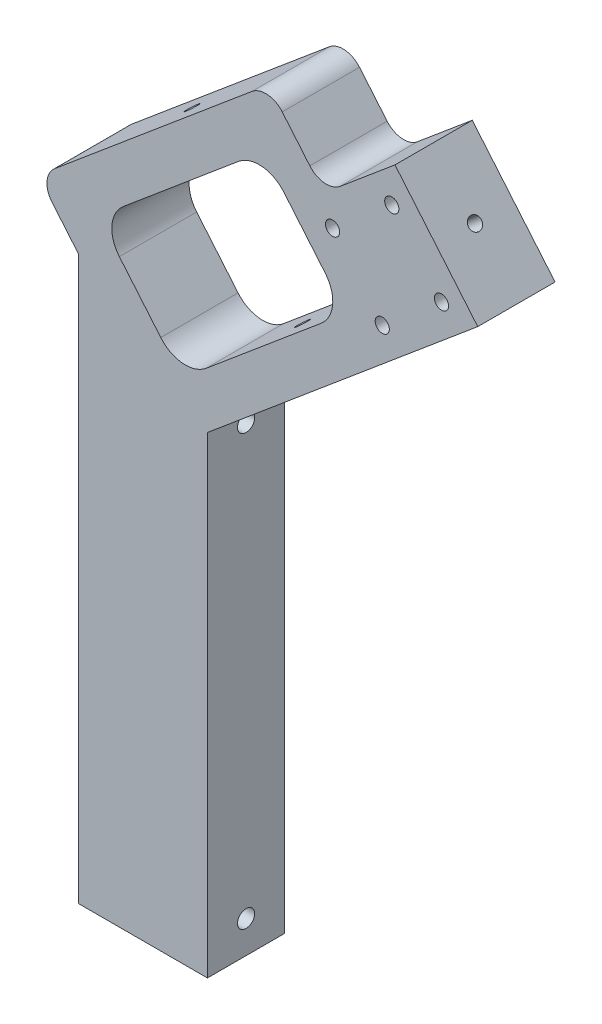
ISO-10303-21;
HEADER;
FILE_DESCRIPTION(('STEP AP214'),'2;1');
FILE_NAME('part.step','',(''),(''),'','','');
FILE_SCHEMA(('AUTOMOTIVE_DESIGN { 1 0 10303 214 1 1 1 1 }'));
ENDSEC;
DATA;
#1=APPLICATION_CONTEXT('core data for automotive mechanical design processes');
#2=APPLICATION_PROTOCOL_DEFINITION('international standard','automotive_design',2000,#1);
#3=PRODUCT_CONTEXT('',#1,'mechanical');
#4=PRODUCT('Part','Part','',(#3));
#5=PRODUCT_RELATED_PRODUCT_CATEGORY('part','',(#4));
#6=PRODUCT_DEFINITION_FORMATION('','',#4);
#7=PRODUCT_DEFINITION_CONTEXT('part definition',#1,'design');
#8=PRODUCT_DEFINITION('design','',#6,#7);
#9=PRODUCT_DEFINITION_SHAPE('','',#8);
#10=(LENGTH_UNIT() NAMED_UNIT(*) SI_UNIT(.MILLI.,.METRE.));
#11=(NAMED_UNIT(*) PLANE_ANGLE_UNIT() SI_UNIT($,.RADIAN.));
#12=(NAMED_UNIT(*) SI_UNIT($,.STERADIAN.) SOLID_ANGLE_UNIT());
#13=UNCERTAINTY_MEASURE_WITH_UNIT(LENGTH_MEASURE(1.E-05),#10,'distance_accuracy_value','');
#14=(GEOMETRIC_REPRESENTATION_CONTEXT(3) GLOBAL_UNCERTAINTY_ASSIGNED_CONTEXT((#13)) GLOBAL_UNIT_ASSIGNED_CONTEXT((#10,
#11,#12)) REPRESENTATION_CONTEXT('',''));
#15=CARTESIAN_POINT('',(0.,0.,0.));
#16=DIRECTION('',(0.,0.,1.));
#17=DIRECTION('',(1.,0.,0.));
#18=AXIS2_PLACEMENT_3D('',#15,#16,#17);
#19=CARTESIAN_POINT('',(-79.7051461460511,143.222848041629,18.));
#20=DIRECTION('',(0.,0.,1.));
#21=DIRECTION('',(1.,0.,0.));
#22=AXIS2_PLACEMENT_3D('',#19,#20,#21);
#23=PLANE('',#22);
#24=CARTESIAN_POINT('',(94.0370996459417,187.188133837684,18.));
#25=DIRECTION('',(0.,0.,1.));
#26=DIRECTION('',(1.,0.,0.));
#27=AXIS2_PLACEMENT_3D('',#24,#25,#26);
#28=CIRCLE('',#27,3.3);
#29=CARTESIAN_POINT('',(97.3370996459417,187.188133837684,18.));
#30=VERTEX_POINT('',#29);
#31=EDGE_CURVE('E365',#30,#30,#28,.T.);
#32=ORIENTED_EDGE('',*,*,#31,.F.);
#33=EDGE_LOOP('',(#32));
#34=FACE_BOUND('',#33,.T.);
#35=CARTESIAN_POINT('',(43.3191457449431,191.625379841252,18.));
#36=DIRECTION('',(0.,0.,1.));
#37=DIRECTION('',(1.,0.,0.));
#38=AXIS2_PLACEMENT_3D('',#35,#36,#37);
#39=CIRCLE('',#38,3.3);
#40=CARTESIAN_POINT('',(46.6191457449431,191.625379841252,18.));
#41=VERTEX_POINT('',#40);
#42=EDGE_CURVE('E214',#41,#41,#39,.T.);
#43=ORIENTED_EDGE('',*,*,#42,.F.);
#44=EDGE_LOOP('',(#43));
#45=FACE_BOUND('',#44,.T.);
#46=DIRECTION('',(1.,0.,0.));
#47=VECTOR('',#46,1.);
#48=CARTESIAN_POINT('',(-14.9598612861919,-139.936063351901,18.));
#49=LINE('',#48,#47);
#50=CARTESIAN_POINT('',(-74.9598612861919,-139.936063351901,18.));
#51=VERTEX_POINT('',#50);
#52=CARTESIAN_POINT('',(-14.9598612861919,-139.936063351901,18.));
#53=VERTEX_POINT('',#52);
#54=EDGE_CURVE('E244',#51,#53,#49,.T.);
#55=ORIENTED_EDGE('',*,*,#54,.T.);
#56=DIRECTION('',(0.,1.,0.));
#57=VECTOR('',#56,1.);
#58=CARTESIAN_POINT('',(-14.9598612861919,80.0639366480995,18.));
#59=LINE('',#58,#57);
#60=CARTESIAN_POINT('',(-14.9598612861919,80.0639366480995,18.));
#61=VERTEX_POINT('',#60);
#62=EDGE_CURVE('E247',#53,#61,#59,.T.);
#63=ORIENTED_EDGE('',*,*,#62,.T.);
#64=DIRECTION('',(0.766044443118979,0.642787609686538,0.));
#65=VECTOR('',#64,1.);
#66=CARTESIAN_POINT('',(110.943084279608,185.709051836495,18.));
#67=LINE('',#66,#65);
#68=CARTESIAN_POINT('',(110.943084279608,185.709051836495,18.));
#69=VERTEX_POINT('',#68);
#70=EDGE_CURVE('E250',#61,#69,#67,.T.);
#71=ORIENTED_EDGE('',*,*,#70,.T.);
#72=DIRECTION('',(-0.642787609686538,0.766044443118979,0.));
#73=VECTOR('',#72,1.);
#74=CARTESIAN_POINT('',(72.3758276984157,231.671718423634,18.));
#75=LINE('',#74,#73);
#76=CARTESIAN_POINT('',(72.3758276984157,231.671718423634,18.));
#77=VERTEX_POINT('',#76);
#78=EDGE_CURVE('E252',#69,#77,#75,.T.);
#79=ORIENTED_EDGE('',*,*,#78,.T.);
#80=DIRECTION('',(-0.766044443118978,-0.642787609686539,0.));
#81=VECTOR('',#80,1.);
#82=CARTESIAN_POINT('',(46.8247041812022,210.231780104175,18.));
#83=LINE('',#82,#81);
#84=CARTESIAN_POINT('',(46.8247041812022,210.231780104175,18.));
#85=VERTEX_POINT('',#84);
#86=EDGE_CURVE('E254',#77,#85,#83,.T.);
#87=ORIENTED_EDGE('',*,*,#86,.T.);
#88=CARTESIAN_POINT('',(40.3968280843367,217.892224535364,18.));
#89=DIRECTION('',(0.,0.,-1.));
#90=DIRECTION('',(-1.,0.,0.));
#91=AXIS2_PLACEMENT_3D('',#88,#89,#90);
#92=CIRCLE('',#91,9.99999999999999);
#93=CARTESIAN_POINT('',(32.7363836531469,211.464348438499,18.));
#94=VERTEX_POINT('',#93);
#95=EDGE_CURVE('E256',#85,#94,#92,.T.);
#96=ORIENTED_EDGE('',*,*,#95,.T.);
#97=DIRECTION('',(-0.642787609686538,0.766044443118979,0.));
#98=VECTOR('',#97,1.);
#99=CARTESIAN_POINT('',(32.7363836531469,211.464348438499,18.));
#100=LINE('',#99,#98);
#101=CARTESIAN_POINT('',(19.8806314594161,226.785237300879,18.));
#102=VERTEX_POINT('',#101);
#103=EDGE_CURVE('E258',#94,#102,#100,.T.);
#104=ORIENTED_EDGE('',*,*,#103,.T.);
#105=CARTESIAN_POINT('',(12.2201870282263,220.357361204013,18.));
#106=DIRECTION('',(0.,0.,1.));
#107=DIRECTION('',(1.,0.,0.));
#108=AXIS2_PLACEMENT_3D('',#105,#106,#107);
#109=CIRCLE('',#108,9.99999999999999);
#110=CARTESIAN_POINT('',(5.79231093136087,228.017805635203,18.));
#111=VERTEX_POINT('',#110);
#112=EDGE_CURVE('E260',#102,#111,#109,.T.);
#113=ORIENTED_EDGE('',*,*,#112,.T.);
#114=DIRECTION('',(-0.766044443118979,-0.642787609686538,0.));
#115=VECTOR('',#114,1.);
#116=CARTESIAN_POINT('',(-86.1330222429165,150.883292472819,18.));
#117=LINE('',#116,#115);
#118=CARTESIAN_POINT('',(-86.1330222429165,150.883292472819,18.));
#119=VERTEX_POINT('',#118);
#120=EDGE_CURVE('E262',#111,#119,#117,.T.);
#121=ORIENTED_EDGE('',*,*,#120,.T.);
#122=CARTESIAN_POINT('',(-79.7051461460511,143.222848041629,18.));
#123=DIRECTION('',(0.,0.,1.));
#124=DIRECTION('',(1.,0.,0.));
#125=AXIS2_PLACEMENT_3D('',#122,#123,#124);
#126=CIRCLE('',#125,10.);
#127=CARTESIAN_POINT('',(-87.3655905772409,136.794971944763,18.));
#128=VERTEX_POINT('',#127);
#129=EDGE_CURVE('E264',#119,#128,#126,.T.);
#130=ORIENTED_EDGE('',*,*,#129,.T.);
#131=DIRECTION('',(0.642787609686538,-0.766044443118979,0.));
#132=VECTOR('',#131,1.);
#133=CARTESIAN_POINT('',(-74.9598612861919,122.010399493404,18.));
#134=LINE('',#133,#132);
#135=CARTESIAN_POINT('',(-74.9598612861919,122.010399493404,18.));
#136=VERTEX_POINT('',#135);
#137=EDGE_CURVE('E266',#128,#136,#134,.T.);
#138=ORIENTED_EDGE('',*,*,#137,.T.);
#139=DIRECTION('',(0.,-1.,0.));
#140=VECTOR('',#139,1.);
#141=CARTESIAN_POINT('',(-74.9598612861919,-139.936063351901,18.));
#142=LINE('',#141,#140);
#143=EDGE_CURVE('E268',#136,#51,#142,.T.);
#144=ORIENTED_EDGE('',*,*,#143,.T.);
#145=EDGE_LOOP('',(#55,#63,#71,#79,#87,#96,#104,#113,#121,#130,#138,#144));
#146=FACE_BOUND('',#145,.T.);
#147=DIRECTION('',(0.642787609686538,-0.766044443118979,0.));
#148=VECTOR('',#147,1.);
#149=CARTESIAN_POINT('',(-36.6913831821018,107.51827976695,18.));
#150=LINE('',#149,#148);
#151=CARTESIAN_POINT('',(-55.9750114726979,130.49961306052,18.));
#152=VERTEX_POINT('',#151);
#153=CARTESIAN_POINT('',(-36.6913831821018,107.51827976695,18.));
#154=VERTEX_POINT('',#153);
#155=EDGE_CURVE('E184',#152,#154,#150,.T.);
#156=ORIENTED_EDGE('',*,*,#155,.F.);
#157=CARTESIAN_POINT('',(-44.4843448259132,140.141427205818,18.));
#158=DIRECTION('',(0.,0.,1.));
#159=DIRECTION('',(1.,0.,0.));
#160=AXIS2_PLACEMENT_3D('',#157,#158,#159);
#161=CIRCLE('',#160,15.);
#162=CARTESIAN_POINT('',(-54.1261589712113,151.632093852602,18.));
#163=VERTEX_POINT('',#162);
#164=EDGE_CURVE('E176',#163,#152,#161,.T.);
#165=ORIENTED_EDGE('',*,*,#164,.F.);
#166=DIRECTION('',(-0.766044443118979,-0.642787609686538,0.));
#167=VECTOR('',#166,1.);
#168=CARTESIAN_POINT('',(-54.1261589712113,151.632093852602,18.));
#169=LINE('',#168,#167);
#170=CARTESIAN_POINT('',(-0.503047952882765,196.62722653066,18.));
#171=VERTEX_POINT('',#170);
#172=EDGE_CURVE('E211',#171,#163,#169,.T.);
#173=ORIENTED_EDGE('',*,*,#172,.F.);
#174=CARTESIAN_POINT('',(9.1387661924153,185.136559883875,18.));
#175=DIRECTION('',(0.,0.,1.));
#176=DIRECTION('',(1.,0.,0.));
#177=AXIS2_PLACEMENT_3D('',#174,#175,#176);
#178=CIRCLE('',#177,15.);
#179=CARTESIAN_POINT('',(20.6294328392,194.778374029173,18.));
#180=VERTEX_POINT('',#179);
#181=EDGE_CURVE('E209',#180,#171,#178,.T.);
#182=ORIENTED_EDGE('',*,*,#181,.F.);
#183=DIRECTION('',(-0.642787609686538,0.766044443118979,0.));
#184=VECTOR('',#183,1.);
#185=CARTESIAN_POINT('',(39.9130611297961,171.797040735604,18.));
#186=LINE('',#185,#184);
#187=CARTESIAN_POINT('',(39.9130611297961,171.797040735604,18.));
#188=VERTEX_POINT('',#187);
#189=EDGE_CURVE('E207',#188,#180,#186,.T.);
#190=ORIENTED_EDGE('',*,*,#189,.F.);
#191=CARTESIAN_POINT('',(28.4223944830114,162.155226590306,18.));
#192=DIRECTION('',(0.,0.,1.));
#193=DIRECTION('',(1.,0.,0.));
#194=AXIS2_PLACEMENT_3D('',#191,#192,#193);
#195=CIRCLE('',#194,15.);
#196=CARTESIAN_POINT('',(38.0642086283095,150.664559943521,18.));
#197=VERTEX_POINT('',#196);
#198=EDGE_CURVE('E205',#197,#188,#195,.T.);
#199=ORIENTED_EDGE('',*,*,#198,.F.);
#200=DIRECTION('',(0.766044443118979,0.642787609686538,0.));
#201=VECTOR('',#200,1.);
#202=CARTESIAN_POINT('',(-15.558902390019,105.669427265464,18.));
#203=LINE('',#202,#201);
#204=CARTESIAN_POINT('',(-15.558902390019,105.669427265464,18.));
#205=VERTEX_POINT('',#204);
#206=EDGE_CURVE('E200',#205,#197,#203,.T.);
#207=ORIENTED_EDGE('',*,*,#206,.F.);
#208=CARTESIAN_POINT('',(-25.2007165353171,117.160093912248,18.));
#209=DIRECTION('',(0.,0.,1.));
#210=DIRECTION('',(1.,0.,0.));
#211=AXIS2_PLACEMENT_3D('',#208,#209,#210);
#212=CIRCLE('',#211,15.);
#213=EDGE_CURVE('E198',#154,#205,#212,.T.);
#214=ORIENTED_EDGE('',*,*,#213,.F.);
#215=EDGE_LOOP('',(#156,#165,#173,#182,#190,#199,#207,#214));
#216=FACE_BOUND('',#215,.T.);
#217=CARTESIAN_POINT('',(70.8967456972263,214.765733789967,18.));
#218=DIRECTION('',(0.,0.,1.));
#219=DIRECTION('',(1.,0.,0.));
#220=AXIS2_PLACEMENT_3D('',#217,#218,#219);
#221=CIRCLE('',#220,3.3);
#222=CARTESIAN_POINT('',(74.1967456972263,214.765733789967,18.));
#223=VERTEX_POINT('',#222);
#224=EDGE_CURVE('E371',#223,#223,#221,.T.);
#225=ORIENTED_EDGE('',*,*,#224,.F.);
#226=EDGE_LOOP('',(#225));
#227=FACE_BOUND('',#226,.T.);
#228=CARTESIAN_POINT('',(66.4594996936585,164.047779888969,18.));
#229=DIRECTION('',(0.,0.,1.));
#230=DIRECTION('',(1.,0.,0.));
#231=AXIS2_PLACEMENT_3D('',#228,#229,#230);
#232=CIRCLE('',#231,3.3);
#233=CARTESIAN_POINT('',(69.7594996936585,164.047779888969,18.));
#234=VERTEX_POINT('',#233);
#235=EDGE_CURVE('E359',#234,#234,#232,.T.);
#236=ORIENTED_EDGE('',*,*,#235,.F.);
#237=EDGE_LOOP('',(#236));
#238=FACE_BOUND('',#237,.T.);
#239=ADVANCED_FACE('F33',(#34,#45,#146,#216,#227,#238),#23,.T.);
#240=CARTESIAN_POINT('',(-79.7051461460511,143.222848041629,-18.));
#241=DIRECTION('',(0.,0.,1.));
#242=DIRECTION('',(1.,0.,0.));
#243=AXIS2_PLACEMENT_3D('',#240,#241,#242);
#244=PLANE('',#243);
#245=DIRECTION('',(1.,0.,0.));
#246=VECTOR('',#245,1.);
#247=CARTESIAN_POINT('',(-14.9598612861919,-139.936063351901,-18.));
#248=LINE('',#247,#246);
#249=CARTESIAN_POINT('',(-74.9598612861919,-139.936063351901,-18.));
#250=VERTEX_POINT('',#249);
#251=CARTESIAN_POINT('',(-14.9598612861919,-139.936063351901,-18.));
#252=VERTEX_POINT('',#251);
#253=EDGE_CURVE('E192',#250,#252,#248,.T.);
#254=ORIENTED_EDGE('',*,*,#253,.F.);
#255=DIRECTION('',(0.,-1.,0.));
#256=VECTOR('',#255,1.);
#257=CARTESIAN_POINT('',(-74.9598612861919,-139.936063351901,-18.));
#258=LINE('',#257,#256);
#259=CARTESIAN_POINT('',(-74.9598612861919,122.010399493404,-18.));
#260=VERTEX_POINT('',#259);
#261=EDGE_CURVE('E248',#260,#250,#258,.T.);
#262=ORIENTED_EDGE('',*,*,#261,.F.);
#263=DIRECTION('',(0.642787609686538,-0.766044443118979,0.));
#264=VECTOR('',#263,1.);
#265=CARTESIAN_POINT('',(-74.9598612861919,122.010399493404,-18.));
#266=LINE('',#265,#264);
#267=CARTESIAN_POINT('',(-87.3655905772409,136.794971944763,-18.));
#268=VERTEX_POINT('',#267);
#269=EDGE_CURVE('E291',#268,#260,#266,.T.);
#270=ORIENTED_EDGE('',*,*,#269,.F.);
#271=CARTESIAN_POINT('',(-79.7051461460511,143.222848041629,-18.));
#272=DIRECTION('',(0.,0.,1.));
#273=DIRECTION('',(1.,0.,0.));
#274=AXIS2_PLACEMENT_3D('',#271,#272,#273);
#275=CIRCLE('',#274,10.);
#276=CARTESIAN_POINT('',(-86.1330222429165,150.883292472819,-18.));
#277=VERTEX_POINT('',#276);
#278=EDGE_CURVE('E289',#277,#268,#275,.T.);
#279=ORIENTED_EDGE('',*,*,#278,.F.);
#280=DIRECTION('',(-0.766044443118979,-0.642787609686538,0.));
#281=VECTOR('',#280,1.);
#282=CARTESIAN_POINT('',(-86.1330222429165,150.883292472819,-18.));
#283=LINE('',#282,#281);
#284=CARTESIAN_POINT('',(5.79231093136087,228.017805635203,-18.));
#285=VERTEX_POINT('',#284);
#286=EDGE_CURVE('E287',#285,#277,#283,.T.);
#287=ORIENTED_EDGE('',*,*,#286,.F.);
#288=CARTESIAN_POINT('',(12.2201870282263,220.357361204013,-18.));
#289=DIRECTION('',(0.,0.,1.));
#290=DIRECTION('',(1.,0.,0.));
#291=AXIS2_PLACEMENT_3D('',#288,#289,#290);
#292=CIRCLE('',#291,9.99999999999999);
#293=CARTESIAN_POINT('',(19.8806314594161,226.785237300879,-18.));
#294=VERTEX_POINT('',#293);
#295=EDGE_CURVE('E285',#294,#285,#292,.T.);
#296=ORIENTED_EDGE('',*,*,#295,.F.);
#297=DIRECTION('',(-0.642787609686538,0.766044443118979,0.));
#298=VECTOR('',#297,1.);
#299=CARTESIAN_POINT('',(32.7363836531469,211.464348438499,-18.));
#300=LINE('',#299,#298);
#301=CARTESIAN_POINT('',(32.7363836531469,211.464348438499,-18.));
#302=VERTEX_POINT('',#301);
#303=EDGE_CURVE('E283',#302,#294,#300,.T.);
#304=ORIENTED_EDGE('',*,*,#303,.F.);
#305=CARTESIAN_POINT('',(40.3968280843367,217.892224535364,-18.));
#306=DIRECTION('',(0.,0.,-1.));
#307=DIRECTION('',(-1.,0.,0.));
#308=AXIS2_PLACEMENT_3D('',#305,#306,#307);
#309=CIRCLE('',#308,9.99999999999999);
#310=CARTESIAN_POINT('',(46.8247041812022,210.231780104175,-18.));
#311=VERTEX_POINT('',#310);
#312=EDGE_CURVE('E281',#311,#302,#309,.T.);
#313=ORIENTED_EDGE('',*,*,#312,.F.);
#314=DIRECTION('',(-0.766044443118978,-0.642787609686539,0.));
#315=VECTOR('',#314,1.);
#316=CARTESIAN_POINT('',(46.8247041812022,210.231780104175,-18.));
#317=LINE('',#316,#315);
#318=CARTESIAN_POINT('',(72.3758276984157,231.671718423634,-18.));
#319=VERTEX_POINT('',#318);
#320=EDGE_CURVE('E279',#319,#311,#317,.T.);
#321=ORIENTED_EDGE('',*,*,#320,.F.);
#322=DIRECTION('',(-0.642787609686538,0.766044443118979,0.));
#323=VECTOR('',#322,1.);
#324=CARTESIAN_POINT('',(72.3758276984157,231.671718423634,-18.));
#325=LINE('',#324,#323);
#326=CARTESIAN_POINT('',(110.943084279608,185.709051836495,-18.));
#327=VERTEX_POINT('',#326);
#328=EDGE_CURVE('E277',#327,#319,#325,.T.);
#329=ORIENTED_EDGE('',*,*,#328,.F.);
#330=DIRECTION('',(0.766044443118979,0.642787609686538,0.));
#331=VECTOR('',#330,1.);
#332=CARTESIAN_POINT('',(110.943084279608,185.709051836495,-18.));
#333=LINE('',#332,#331);
#334=CARTESIAN_POINT('',(-14.9598612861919,80.0639366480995,-18.));
#335=VERTEX_POINT('',#334);
#336=EDGE_CURVE('E275',#335,#327,#333,.T.);
#337=ORIENTED_EDGE('',*,*,#336,.F.);
#338=DIRECTION('',(0.,1.,0.));
#339=VECTOR('',#338,1.);
#340=CARTESIAN_POINT('',(-14.9598612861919,80.0639366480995,-18.));
#341=LINE('',#340,#339);
#342=EDGE_CURVE('E273',#252,#335,#341,.T.);
#343=ORIENTED_EDGE('',*,*,#342,.F.);
#344=EDGE_LOOP('',(#254,#262,#270,#279,#287,#296,#304,#313,#321,#329,#337,#343));
#345=FACE_BOUND('',#344,.T.);
#346=CARTESIAN_POINT('',(-44.4843448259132,140.141427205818,-18.));
#347=DIRECTION('',(0.,0.,1.));
#348=DIRECTION('',(1.,0.,0.));
#349=AXIS2_PLACEMENT_3D('',#346,#347,#348);
#350=CIRCLE('',#349,15.);
#351=CARTESIAN_POINT('',(-54.1261589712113,151.632093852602,-18.));
#352=VERTEX_POINT('',#351);
#353=CARTESIAN_POINT('',(-55.9750114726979,130.49961306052,-18.));
#354=VERTEX_POINT('',#353);
#355=EDGE_CURVE('E62',#352,#354,#350,.T.);
#356=ORIENTED_EDGE('',*,*,#355,.T.);
#357=DIRECTION('',(0.642787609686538,-0.766044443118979,0.));
#358=VECTOR('',#357,1.);
#359=CARTESIAN_POINT('',(-36.6913831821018,107.51827976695,-18.));
#360=LINE('',#359,#358);
#361=CARTESIAN_POINT('',(-36.6913831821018,107.51827976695,-18.));
#362=VERTEX_POINT('',#361);
#363=EDGE_CURVE('E191',#354,#362,#360,.T.);
#364=ORIENTED_EDGE('',*,*,#363,.T.);
#365=CARTESIAN_POINT('',(-25.2007165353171,117.160093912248,-18.));
#366=DIRECTION('',(0.,0.,1.));
#367=DIRECTION('',(1.,0.,0.));
#368=AXIS2_PLACEMENT_3D('',#365,#366,#367);
#369=CIRCLE('',#368,15.);
#370=CARTESIAN_POINT('',(-15.558902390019,105.669427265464,-18.));
#371=VERTEX_POINT('',#370);
#372=EDGE_CURVE('E216',#362,#371,#369,.T.);
#373=ORIENTED_EDGE('',*,*,#372,.T.);
#374=DIRECTION('',(0.766044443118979,0.642787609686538,0.));
#375=VECTOR('',#374,1.);
#376=CARTESIAN_POINT('',(-15.558902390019,105.669427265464,-18.));
#377=LINE('',#376,#375);
#378=CARTESIAN_POINT('',(38.0642086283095,150.664559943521,-18.));
#379=VERTEX_POINT('',#378);
#380=EDGE_CURVE('E219',#371,#379,#377,.T.);
#381=ORIENTED_EDGE('',*,*,#380,.T.);
#382=CARTESIAN_POINT('',(28.4223944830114,162.155226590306,-18.));
#383=DIRECTION('',(0.,0.,1.));
#384=DIRECTION('',(1.,0.,0.));
#385=AXIS2_PLACEMENT_3D('',#382,#383,#384);
#386=CIRCLE('',#385,15.);
#387=CARTESIAN_POINT('',(39.9130611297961,171.797040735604,-18.));
#388=VERTEX_POINT('',#387);
#389=EDGE_CURVE('E222',#379,#388,#386,.T.);
#390=ORIENTED_EDGE('',*,*,#389,.T.);
#391=DIRECTION('',(-0.642787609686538,0.766044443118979,0.));
#392=VECTOR('',#391,1.);
#393=CARTESIAN_POINT('',(39.9130611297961,171.797040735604,-18.));
#394=LINE('',#393,#392);
#395=CARTESIAN_POINT('',(20.6294328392,194.778374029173,-18.));
#396=VERTEX_POINT('',#395);
#397=EDGE_CURVE('E225',#388,#396,#394,.T.);
#398=ORIENTED_EDGE('',*,*,#397,.T.);
#399=CARTESIAN_POINT('',(9.1387661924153,185.136559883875,-18.));
#400=DIRECTION('',(0.,0.,1.));
#401=DIRECTION('',(1.,0.,0.));
#402=AXIS2_PLACEMENT_3D('',#399,#400,#401);
#403=CIRCLE('',#402,15.);
#404=CARTESIAN_POINT('',(-0.503047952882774,196.62722653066,-18.));
#405=VERTEX_POINT('',#404);
#406=EDGE_CURVE('E228',#396,#405,#403,.T.);
#407=ORIENTED_EDGE('',*,*,#406,.T.);
#408=DIRECTION('',(-0.766044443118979,-0.642787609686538,0.));
#409=VECTOR('',#408,1.);
#410=CARTESIAN_POINT('',(-54.1261589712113,151.632093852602,-18.));
#411=LINE('',#410,#409);
#412=EDGE_CURVE('E185',#405,#352,#411,.T.);
#413=ORIENTED_EDGE('',*,*,#412,.T.);
#414=EDGE_LOOP('',(#356,#364,#373,#381,#390,#398,#407,#413));
#415=FACE_BOUND('',#414,.T.);
#416=CARTESIAN_POINT('',(43.3191457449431,191.625379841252,-18.));
#417=DIRECTION('',(0.,0.,1.));
#418=DIRECTION('',(1.,0.,0.));
#419=AXIS2_PLACEMENT_3D('',#416,#417,#418);
#420=CIRCLE('',#419,3.3);
#421=CARTESIAN_POINT('',(46.6191457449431,191.625379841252,-18.));
#422=VERTEX_POINT('',#421);
#423=EDGE_CURVE('E374',#422,#422,#420,.T.);
#424=ORIENTED_EDGE('',*,*,#423,.T.);
#425=EDGE_LOOP('',(#424));
#426=FACE_BOUND('',#425,.T.);
#427=CARTESIAN_POINT('',(70.8967456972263,214.765733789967,-18.));
#428=DIRECTION('',(0.,0.,1.));
#429=DIRECTION('',(1.,0.,0.));
#430=AXIS2_PLACEMENT_3D('',#427,#428,#429);
#431=CIRCLE('',#430,3.3);
#432=CARTESIAN_POINT('',(74.1967456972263,214.765733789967,-18.));
#433=VERTEX_POINT('',#432);
#434=EDGE_CURVE('E368',#433,#433,#431,.T.);
#435=ORIENTED_EDGE('',*,*,#434,.T.);
#436=EDGE_LOOP('',(#435));
#437=FACE_BOUND('',#436,.T.);
#438=CARTESIAN_POINT('',(94.0370996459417,187.188133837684,-18.));
#439=DIRECTION('',(0.,0.,1.));
#440=DIRECTION('',(1.,0.,0.));
#441=AXIS2_PLACEMENT_3D('',#438,#439,#440);
#442=CIRCLE('',#441,3.3);
#443=CARTESIAN_POINT('',(97.3370996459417,187.188133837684,-18.));
#444=VERTEX_POINT('',#443);
#445=EDGE_CURVE('E362',#444,#444,#442,.T.);
#446=ORIENTED_EDGE('',*,*,#445,.T.);
#447=EDGE_LOOP('',(#446));
#448=FACE_BOUND('',#447,.T.);
#449=CARTESIAN_POINT('',(66.4594996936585,164.047779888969,-18.));
#450=DIRECTION('',(0.,0.,1.));
#451=DIRECTION('',(1.,0.,0.));
#452=AXIS2_PLACEMENT_3D('',#449,#450,#451);
#453=CIRCLE('',#452,3.3);
#454=CARTESIAN_POINT('',(69.7594996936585,164.047779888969,-18.));
#455=VERTEX_POINT('',#454);
#456=EDGE_CURVE('E358',#455,#455,#453,.T.);
#457=ORIENTED_EDGE('',*,*,#456,.T.);
#458=EDGE_LOOP('',(#457));
#459=FACE_BOUND('',#458,.T.);
#460=ADVANCED_FACE('F381',(#345,#415,#426,#437,#448,#459),#244,.F.);
#461=CARTESIAN_POINT('',(-14.9598612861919,-139.936063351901,18.));
#462=DIRECTION('',(0.,1.,0.));
#463=DIRECTION('',(0.,0.,1.));
#464=AXIS2_PLACEMENT_3D('',#461,#462,#463);
#465=PLANE('',#464);
#466=ORIENTED_EDGE('',*,*,#253,.T.);
#467=DIRECTION('',(0.,0.,-1.));
#468=VECTOR('',#467,1.);
#469=CARTESIAN_POINT('',(-14.9598612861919,-139.936063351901,18.));
#470=LINE('',#469,#468);
#471=EDGE_CURVE('E11',#53,#252,#470,.T.);
#472=ORIENTED_EDGE('',*,*,#471,.F.);
#473=ORIENTED_EDGE('',*,*,#54,.F.);
#474=DIRECTION('',(0.,0.,-1.));
#475=VECTOR('',#474,1.);
#476=CARTESIAN_POINT('',(-74.9598612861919,-139.936063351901,18.));
#477=LINE('',#476,#475);
#478=EDGE_CURVE('E270',#51,#250,#477,.T.);
#479=ORIENTED_EDGE('',*,*,#478,.T.);
#480=EDGE_LOOP('',(#466,#472,#473,#479));
#481=FACE_BOUND('',#480,.T.);
#482=ADVANCED_FACE('F35',(#481),#465,.F.);
#483=CARTESIAN_POINT('',(-14.9598612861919,80.0639366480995,18.));
#484=DIRECTION('',(-1.,0.,0.));
#485=DIRECTION('',(0.,-1.,0.));
#486=AXIS2_PLACEMENT_3D('',#483,#484,#485);
#487=PLANE('',#486);
#488=CARTESIAN_POINT('',(-14.9598612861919,75.0639366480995,6.98296267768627E-13));
#489=DIRECTION('',(-1.,0.,0.));
#490=DIRECTION('',(0.,-1.,0.));
#491=AXIS2_PLACEMENT_3D('',#488,#489,#490);
#492=CIRCLE('',#491,4.);
#493=CARTESIAN_POINT('',(-14.9598612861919,71.0639366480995,6.98296267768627E-13));
#494=VERTEX_POINT('',#493);
#495=EDGE_CURVE('E329',#494,#494,#492,.T.);
#496=ORIENTED_EDGE('',*,*,#495,.T.);
#497=EDGE_LOOP('',(#496));
#498=FACE_BOUND('',#497,.T.);
#499=CARTESIAN_POINT('',(-14.9598612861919,-124.936063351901,0.));
#500=DIRECTION('',(-1.,0.,0.));
#501=DIRECTION('',(0.,-1.,0.));
#502=AXIS2_PLACEMENT_3D('',#499,#500,#501);
#503=CIRCLE('',#502,4.);
#504=CARTESIAN_POINT('',(-14.9598612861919,-128.936063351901,0.));
#505=VERTEX_POINT('',#504);
#506=EDGE_CURVE('E328',#505,#505,#503,.T.);
#507=ORIENTED_EDGE('',*,*,#506,.T.);
#508=EDGE_LOOP('',(#507));
#509=FACE_BOUND('',#508,.T.);
#510=ORIENTED_EDGE('',*,*,#342,.T.);
#511=DIRECTION('',(0.,0.,-1.));
#512=VECTOR('',#511,1.);
#513=CARTESIAN_POINT('',(-14.9598612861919,80.0639366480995,18.));
#514=LINE('',#513,#512);
#515=EDGE_CURVE('E46',#61,#335,#514,.T.);
#516=ORIENTED_EDGE('',*,*,#515,.F.);
#517=ORIENTED_EDGE('',*,*,#62,.F.);
#518=ORIENTED_EDGE('',*,*,#471,.T.);
#519=EDGE_LOOP('',(#510,#516,#517,#518));
#520=FACE_BOUND('',#519,.T.);
#521=ADVANCED_FACE('F451',(#498,#509,#520),#487,.F.);
#522=CARTESIAN_POINT('',(110.943084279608,185.709051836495,18.));
#523=DIRECTION('',(-0.642787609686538,0.766044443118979,0.));
#524=DIRECTION('',(-0.766044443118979,-0.642787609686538,0.));
#525=AXIS2_PLACEMENT_3D('',#522,#523,#524);
#526=PLANE('',#525);
#527=CARTESIAN_POINT('',(24.1084053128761,112.846104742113,0.));
#528=DIRECTION('',(-0.642787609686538,0.766044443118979,0.));
#529=DIRECTION('',(-0.766044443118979,-0.642787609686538,0.));
#530=AXIS2_PLACEMENT_3D('',#527,#528,#529);
#531=CIRCLE('',#530,3.);
#532=CARTESIAN_POINT('',(21.8102719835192,110.917741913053,0.));
#533=VERTEX_POINT('',#532);
#534=EDGE_CURVE('E332',#533,#533,#531,.T.);
#535=ORIENTED_EDGE('',*,*,#534,.T.);
#536=EDGE_LOOP('',(#535));
#537=FACE_BOUND('',#536,.T.);
#538=ORIENTED_EDGE('',*,*,#336,.T.);
#539=DIRECTION('',(0.,0.,-1.));
#540=VECTOR('',#539,1.);
#541=CARTESIAN_POINT('',(110.943084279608,185.709051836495,18.));
#542=LINE('',#541,#540);
#543=EDGE_CURVE('E320',#69,#327,#542,.T.);
#544=ORIENTED_EDGE('',*,*,#543,.F.);
#545=ORIENTED_EDGE('',*,*,#70,.F.);
#546=ORIENTED_EDGE('',*,*,#515,.T.);
#547=EDGE_LOOP('',(#538,#544,#545,#546));
#548=FACE_BOUND('',#547,.T.);
#549=ADVANCED_FACE('F448',(#537,#548),#526,.F.);
#550=CARTESIAN_POINT('',(72.3758276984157,231.671718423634,18.));
#551=DIRECTION('',(-0.766044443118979,-0.642787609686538,0.));
#552=DIRECTION('',(0.642787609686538,-0.766044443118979,0.));
#553=AXIS2_PLACEMENT_3D('',#550,#551,#552);
#554=PLANE('',#553);
#555=CARTESIAN_POINT('',(91.6594559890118,208.690385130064,0.));
#556=DIRECTION('',(0.766044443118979,0.642787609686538,0.));
#557=DIRECTION('',(-0.642787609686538,0.766044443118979,0.));
#558=AXIS2_PLACEMENT_3D('',#555,#556,#557);
#559=CIRCLE('',#558,3.);
#560=CARTESIAN_POINT('',(89.7310931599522,210.988518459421,0.));
#561=VERTEX_POINT('',#560);
#562=EDGE_CURVE('E342',#561,#561,#559,.T.);
#563=ORIENTED_EDGE('',*,*,#562,.F.);
#564=EDGE_LOOP('',(#563));
#565=FACE_BOUND('',#564,.T.);
#566=ORIENTED_EDGE('',*,*,#328,.T.);
#567=DIRECTION('',(0.,0.,-1.));
#568=VECTOR('',#567,1.);
#569=CARTESIAN_POINT('',(72.3758276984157,231.671718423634,18.));
#570=LINE('',#569,#568);
#571=EDGE_CURVE('E317',#77,#319,#570,.T.);
#572=ORIENTED_EDGE('',*,*,#571,.F.);
#573=ORIENTED_EDGE('',*,*,#78,.F.);
#574=ORIENTED_EDGE('',*,*,#543,.T.);
#575=EDGE_LOOP('',(#566,#572,#573,#574));
#576=FACE_BOUND('',#575,.T.);
#577=ADVANCED_FACE('F444',(#565,#576),#554,.F.);
#578=CARTESIAN_POINT('',(46.8247041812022,210.231780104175,18.));
#579=DIRECTION('',(0.642787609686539,-0.766044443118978,0.));
#580=DIRECTION('',(0.766044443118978,0.642787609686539,0.));
#581=AXIS2_PLACEMENT_3D('',#578,#579,#580);
#582=PLANE('',#581);
#583=ORIENTED_EDGE('',*,*,#320,.T.);
#584=DIRECTION('',(0.,0.,-1.));
#585=VECTOR('',#584,1.);
#586=CARTESIAN_POINT('',(46.8247041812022,210.231780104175,18.));
#587=LINE('',#586,#585);
#588=EDGE_CURVE('E314',#85,#311,#587,.T.);
#589=ORIENTED_EDGE('',*,*,#588,.F.);
#590=ORIENTED_EDGE('',*,*,#86,.F.);
#591=ORIENTED_EDGE('',*,*,#571,.T.);
#592=EDGE_LOOP('',(#583,#589,#590,#591));
#593=FACE_BOUND('',#592,.T.);
#594=ADVANCED_FACE('F440',(#593),#582,.F.);
#595=CARTESIAN_POINT('',(40.3968280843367,217.892224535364,18.));
#596=DIRECTION('',(0.,0.,-1.));
#597=DIRECTION('',(-1.,0.,0.));
#598=AXIS2_PLACEMENT_3D('',#595,#596,#597);
#599=CYLINDRICAL_SURFACE('',#598,9.99999999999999);
#600=ORIENTED_EDGE('',*,*,#312,.T.);
#601=DIRECTION('',(0.,0.,-1.));
#602=VECTOR('',#601,1.);
#603=CARTESIAN_POINT('',(32.7363836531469,211.464348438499,18.));
#604=LINE('',#603,#602);
#605=EDGE_CURVE('E311',#94,#302,#604,.T.);
#606=ORIENTED_EDGE('',*,*,#605,.F.);
#607=ORIENTED_EDGE('',*,*,#95,.F.);
#608=ORIENTED_EDGE('',*,*,#588,.T.);
#609=EDGE_LOOP('',(#600,#606,#607,#608));
#610=FACE_BOUND('',#609,.T.);
#611=ADVANCED_FACE('F436',(#610),#599,.F.);
#612=CARTESIAN_POINT('',(32.7363836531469,211.464348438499,18.));
#613=DIRECTION('',(-0.766044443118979,-0.642787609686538,0.));
#614=DIRECTION('',(0.642787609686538,-0.766044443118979,0.));
#615=AXIS2_PLACEMENT_3D('',#612,#613,#614);
#616=PLANE('',#615);
#617=ORIENTED_EDGE('',*,*,#303,.T.);
#618=DIRECTION('',(0.,0.,-1.));
#619=VECTOR('',#618,1.);
#620=CARTESIAN_POINT('',(19.8806314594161,226.785237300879,18.));
#621=LINE('',#620,#619);
#622=EDGE_CURVE('E308',#102,#294,#621,.T.);
#623=ORIENTED_EDGE('',*,*,#622,.F.);
#624=ORIENTED_EDGE('',*,*,#103,.F.);
#625=ORIENTED_EDGE('',*,*,#605,.T.);
#626=EDGE_LOOP('',(#617,#623,#624,#625));
#627=FACE_BOUND('',#626,.T.);
#628=ADVANCED_FACE('F432',(#627),#616,.F.);
#629=CARTESIAN_POINT('',(12.2201870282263,220.357361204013,18.));
#630=DIRECTION('',(0.,0.,-1.));
#631=DIRECTION('',(-1.,0.,0.));
#632=AXIS2_PLACEMENT_3D('',#629,#630,#631);
#633=CYLINDRICAL_SURFACE('',#632,9.99999999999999);
#634=ORIENTED_EDGE('',*,*,#295,.T.);
#635=DIRECTION('',(0.,0.,-1.));
#636=VECTOR('',#635,1.);
#637=CARTESIAN_POINT('',(5.79231093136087,228.017805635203,18.));
#638=LINE('',#637,#636);
#639=EDGE_CURVE('E305',#111,#285,#638,.T.);
#640=ORIENTED_EDGE('',*,*,#639,.F.);
#641=ORIENTED_EDGE('',*,*,#112,.F.);
#642=ORIENTED_EDGE('',*,*,#622,.T.);
#643=EDGE_LOOP('',(#634,#640,#641,#642));
#644=FACE_BOUND('',#643,.T.);
#645=ADVANCED_FACE('F428',(#644),#633,.T.);
#646=CARTESIAN_POINT('',(-86.1330222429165,150.883292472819,18.));
#647=DIRECTION('',(0.642787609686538,-0.766044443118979,0.));
#648=DIRECTION('',(0.766044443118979,0.642787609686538,0.));
#649=AXIS2_PLACEMENT_3D('',#646,#647,#648);
#650=PLANE('',#649);
#651=CARTESIAN_POINT('',(-40.1703556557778,189.450549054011,0.));
#652=DIRECTION('',(0.642787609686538,-0.766044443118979,0.));
#653=DIRECTION('',(0.766044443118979,0.642787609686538,0.));
#654=AXIS2_PLACEMENT_3D('',#651,#652,#653);
#655=CIRCLE('',#654,3.);
#656=CARTESIAN_POINT('',(-37.8722223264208,191.378911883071,0.));
#657=VERTEX_POINT('',#656);
#658=EDGE_CURVE('E339',#657,#657,#655,.T.);
#659=ORIENTED_EDGE('',*,*,#658,.T.);
#660=EDGE_LOOP('',(#659));
#661=FACE_BOUND('',#660,.T.);
#662=ORIENTED_EDGE('',*,*,#286,.T.);
#663=DIRECTION('',(0.,0.,-1.));
#664=VECTOR('',#663,1.);
#665=CARTESIAN_POINT('',(-86.1330222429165,150.883292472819,18.));
#666=LINE('',#665,#664);
#667=EDGE_CURVE('E302',#119,#277,#666,.T.);
#668=ORIENTED_EDGE('',*,*,#667,.F.);
#669=ORIENTED_EDGE('',*,*,#120,.F.);
#670=ORIENTED_EDGE('',*,*,#639,.T.);
#671=EDGE_LOOP('',(#662,#668,#669,#670));
#672=FACE_BOUND('',#671,.T.);
#673=ADVANCED_FACE('F424',(#661,#672),#650,.F.);
#674=CARTESIAN_POINT('',(-79.7051461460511,143.222848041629,18.));
#675=DIRECTION('',(0.,0.,-1.));
#676=DIRECTION('',(-1.,0.,0.));
#677=AXIS2_PLACEMENT_3D('',#674,#675,#676);
#678=CYLINDRICAL_SURFACE('',#677,10.);
#679=ORIENTED_EDGE('',*,*,#278,.T.);
#680=DIRECTION('',(0.,0.,-1.));
#681=VECTOR('',#680,1.);
#682=CARTESIAN_POINT('',(-87.3655905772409,136.794971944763,18.));
#683=LINE('',#682,#681);
#684=EDGE_CURVE('E299',#128,#268,#683,.T.);
#685=ORIENTED_EDGE('',*,*,#684,.F.);
#686=ORIENTED_EDGE('',*,*,#129,.F.);
#687=ORIENTED_EDGE('',*,*,#667,.T.);
#688=EDGE_LOOP('',(#679,#685,#686,#687));
#689=FACE_BOUND('',#688,.T.);
#690=ADVANCED_FACE('F420',(#689),#678,.T.);
#691=CARTESIAN_POINT('',(-74.9598612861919,122.010399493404,18.));
#692=DIRECTION('',(0.766044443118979,0.642787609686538,0.));
#693=DIRECTION('',(-0.642787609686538,0.766044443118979,0.));
#694=AXIS2_PLACEMENT_3D('',#691,#692,#693);
#695=PLANE('',#694);
#696=ORIENTED_EDGE('',*,*,#269,.T.);
#697=DIRECTION('',(0.,0.,-1.));
#698=VECTOR('',#697,1.);
#699=CARTESIAN_POINT('',(-74.9598612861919,122.010399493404,18.));
#700=LINE('',#699,#698);
#701=EDGE_CURVE('E296',#136,#260,#700,.T.);
#702=ORIENTED_EDGE('',*,*,#701,.F.);
#703=ORIENTED_EDGE('',*,*,#137,.F.);
#704=ORIENTED_EDGE('',*,*,#684,.T.);
#705=EDGE_LOOP('',(#696,#702,#703,#704));
#706=FACE_BOUND('',#705,.T.);
#707=ADVANCED_FACE('F416',(#706),#695,.F.);
#708=CARTESIAN_POINT('',(-74.9598612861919,-139.936063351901,18.));
#709=DIRECTION('',(1.,0.,0.));
#710=DIRECTION('',(0.,0.,-1.));
#711=AXIS2_PLACEMENT_3D('',#708,#709,#710);
#712=PLANE('',#711);
#713=CARTESIAN_POINT('',(-74.9598612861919,75.0639366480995,6.98296267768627E-13));
#714=DIRECTION('',(1.,0.,0.));
#715=DIRECTION('',(0.,0.,-1.));
#716=AXIS2_PLACEMENT_3D('',#713,#714,#715);
#717=CIRCLE('',#716,4.);
#718=CARTESIAN_POINT('',(-74.9598612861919,75.0639366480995,-3.99999999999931));
#719=VERTEX_POINT('',#718);
#720=EDGE_CURVE('E330',#719,#719,#717,.T.);
#721=ORIENTED_EDGE('',*,*,#720,.T.);
#722=EDGE_LOOP('',(#721));
#723=FACE_BOUND('',#722,.T.);
#724=CARTESIAN_POINT('',(-74.9598612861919,-124.936063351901,0.));
#725=DIRECTION('',(1.,0.,0.));
#726=DIRECTION('',(0.,0.,-1.));
#727=AXIS2_PLACEMENT_3D('',#724,#725,#726);
#728=CIRCLE('',#727,4.);
#729=CARTESIAN_POINT('',(-74.9598612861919,-124.936063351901,-4.));
#730=VERTEX_POINT('',#729);
#731=EDGE_CURVE('E325',#730,#730,#728,.T.);
#732=ORIENTED_EDGE('',*,*,#731,.T.);
#733=EDGE_LOOP('',(#732));
#734=FACE_BOUND('',#733,.T.);
#735=ORIENTED_EDGE('',*,*,#261,.T.);
#736=ORIENTED_EDGE('',*,*,#478,.F.);
#737=ORIENTED_EDGE('',*,*,#143,.F.);
#738=ORIENTED_EDGE('',*,*,#701,.T.);
#739=EDGE_LOOP('',(#735,#736,#737,#738));
#740=FACE_BOUND('',#739,.T.);
#741=ADVANCED_FACE('F413',(#723,#734,#740),#712,.F.);
#742=CARTESIAN_POINT('',(-44.4843448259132,140.141427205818,18.));
#743=DIRECTION('',(0.,0.,-1.));
#744=DIRECTION('',(-1.,0.,0.));
#745=AXIS2_PLACEMENT_3D('',#742,#743,#744);
#746=CYLINDRICAL_SURFACE('',#745,15.);
#747=ORIENTED_EDGE('',*,*,#355,.F.);
#748=DIRECTION('',(0.,0.,-1.));
#749=VECTOR('',#748,1.);
#750=CARTESIAN_POINT('',(-54.1261589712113,151.632093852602,18.));
#751=LINE('',#750,#749);
#752=EDGE_CURVE('E180',#163,#352,#751,.T.);
#753=ORIENTED_EDGE('',*,*,#752,.F.);
#754=ORIENTED_EDGE('',*,*,#164,.T.);
#755=DIRECTION('',(0.,0.,-1.));
#756=VECTOR('',#755,1.);
#757=CARTESIAN_POINT('',(-55.9750114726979,130.49961306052,18.));
#758=LINE('',#757,#756);
#759=EDGE_CURVE('E179',#152,#354,#758,.T.);
#760=ORIENTED_EDGE('',*,*,#759,.T.);
#761=EDGE_LOOP('',(#747,#753,#754,#760));
#762=FACE_BOUND('',#761,.T.);
#763=ADVANCED_FACE('F178',(#762),#746,.F.);
#764=CARTESIAN_POINT('',(-36.6913831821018,107.51827976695,18.));
#765=DIRECTION('',(0.766044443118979,0.642787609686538,0.));
#766=DIRECTION('',(-0.642787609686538,0.766044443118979,0.));
#767=AXIS2_PLACEMENT_3D('',#764,#765,#766);
#768=PLANE('',#767);
#769=ORIENTED_EDGE('',*,*,#363,.F.);
#770=ORIENTED_EDGE('',*,*,#759,.F.);
#771=ORIENTED_EDGE('',*,*,#155,.T.);
#772=DIRECTION('',(0.,0.,-1.));
#773=VECTOR('',#772,1.);
#774=CARTESIAN_POINT('',(-36.6913831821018,107.51827976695,18.));
#775=LINE('',#774,#773);
#776=EDGE_CURVE('E193',#154,#362,#775,.T.);
#777=ORIENTED_EDGE('',*,*,#776,.T.);
#778=EDGE_LOOP('',(#769,#770,#771,#777));
#779=FACE_BOUND('',#778,.T.);
#780=ADVANCED_FACE('F188',(#779),#768,.T.);
#781=CARTESIAN_POINT('',(-25.2007165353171,117.160093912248,18.));
#782=DIRECTION('',(0.,0.,-1.));
#783=DIRECTION('',(-1.,0.,0.));
#784=AXIS2_PLACEMENT_3D('',#781,#782,#783);
#785=CYLINDRICAL_SURFACE('',#784,15.);
#786=ORIENTED_EDGE('',*,*,#372,.F.);
#787=ORIENTED_EDGE('',*,*,#776,.F.);
#788=ORIENTED_EDGE('',*,*,#213,.T.);
#789=DIRECTION('',(0.,0.,-1.));
#790=VECTOR('',#789,1.);
#791=CARTESIAN_POINT('',(-15.558902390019,105.669427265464,18.));
#792=LINE('',#791,#790);
#793=EDGE_CURVE('E241',#205,#371,#792,.T.);
#794=ORIENTED_EDGE('',*,*,#793,.T.);
#795=EDGE_LOOP('',(#786,#787,#788,#794));
#796=FACE_BOUND('',#795,.T.);
#797=ADVANCED_FACE('F523',(#796),#785,.F.);
#798=CARTESIAN_POINT('',(-15.558902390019,105.669427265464,18.));
#799=DIRECTION('',(-0.642787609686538,0.766044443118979,0.));
#800=DIRECTION('',(-0.766044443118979,-0.642787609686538,0.));
#801=AXIS2_PLACEMENT_3D('',#798,#799,#800);
#802=PLANE('',#801);
#803=CARTESIAN_POINT('',(11.2526531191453,128.166993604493,0.));
#804=DIRECTION('',(-0.642787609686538,0.766044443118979,0.));
#805=DIRECTION('',(-0.766044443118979,-0.642787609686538,0.));
#806=AXIS2_PLACEMENT_3D('',#803,#804,#805);
#807=CIRCLE('',#806,3.);
#808=CARTESIAN_POINT('',(8.95451978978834,126.238630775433,0.));
#809=VERTEX_POINT('',#808);
#810=EDGE_CURVE('E335',#809,#809,#807,.T.);
#811=ORIENTED_EDGE('',*,*,#810,.F.);
#812=EDGE_LOOP('',(#811));
#813=FACE_BOUND('',#812,.T.);
#814=ORIENTED_EDGE('',*,*,#380,.F.);
#815=ORIENTED_EDGE('',*,*,#793,.F.);
#816=ORIENTED_EDGE('',*,*,#206,.T.);
#817=DIRECTION('',(0.,0.,-1.));
#818=VECTOR('',#817,1.);
#819=CARTESIAN_POINT('',(38.0642086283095,150.664559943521,18.));
#820=LINE('',#819,#818);
#821=EDGE_CURVE('E239',#197,#379,#820,.T.);
#822=ORIENTED_EDGE('',*,*,#821,.T.);
#823=EDGE_LOOP('',(#814,#815,#816,#822));
#824=FACE_BOUND('',#823,.T.);
#825=ADVANCED_FACE('F520',(#813,#824),#802,.T.);
#826=CARTESIAN_POINT('',(28.4223944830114,162.155226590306,18.));
#827=DIRECTION('',(0.,0.,-1.));
#828=DIRECTION('',(-1.,0.,0.));
#829=AXIS2_PLACEMENT_3D('',#826,#827,#828);
#830=CYLINDRICAL_SURFACE('',#829,15.);
#831=CARTESIAN_POINT('',(41.0960390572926,170.178862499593,0.));
#832=CARTESIAN_POINT('',(41.0960439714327,170.178858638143,-0.166918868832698));
#833=CARTESIAN_POINT('',(41.1035977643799,170.166961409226,-0.333921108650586));
#834=CARTESIAN_POINT('',(41.1334290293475,170.119544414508,-0.663290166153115));
#835=CARTESIAN_POINT('',(41.1557187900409,170.084004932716,-0.82565299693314));
#836=CARTESIAN_POINT('',(41.2138169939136,169.989928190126,-1.14099605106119));
#837=CARTESIAN_POINT('',(41.2496220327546,169.931396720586,-1.29397862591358));
#838=CARTESIAN_POINT('',(41.3328215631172,169.792464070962,-1.58620628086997));
#839=CARTESIAN_POINT('',(41.3802136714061,169.712067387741,-1.72545417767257));
#840=CARTESIAN_POINT('',(41.4840128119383,169.531197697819,-1.98615971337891));
#841=CARTESIAN_POINT('',(41.5404083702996,169.430750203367,-2.10763962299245));
#842=CARTESIAN_POINT('',(41.6593542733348,169.212021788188,-2.32972144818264));
#843=CARTESIAN_POINT('',(41.7219045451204,169.093741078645,-2.4303236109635));
#844=CARTESIAN_POINT('',(41.8503278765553,168.841827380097,-2.60847710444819));
#845=CARTESIAN_POINT('',(41.9162116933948,168.708142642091,-2.68594739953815));
#846=CARTESIAN_POINT('',(42.0481410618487,168.429206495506,-2.81582221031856));
#847=CARTESIAN_POINT('',(42.1141866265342,168.283954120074,-2.86822462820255));
#848=CARTESIAN_POINT('',(42.2454937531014,167.981864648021,-2.9483816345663));
#849=CARTESIAN_POINT('',(42.3106936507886,167.82482789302,-2.97548204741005));
#850=CARTESIAN_POINT('',(42.436387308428,167.506609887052,-3.00303198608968));
#851=CARTESIAN_POINT('',(42.4968798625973,167.345427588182,-3.0034747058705));
#852=CARTESIAN_POINT('',(42.6149297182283,167.013689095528,-2.97794066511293));
#853=CARTESIAN_POINT('',(42.6721251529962,166.843120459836,-2.9504619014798));
#854=CARTESIAN_POINT('',(42.7786166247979,166.506108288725,-2.86832828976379));
#855=CARTESIAN_POINT('',(42.8279097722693,166.339666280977,-2.81366353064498));
#856=CARTESIAN_POINT('',(42.9212664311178,166.004249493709,-2.67428633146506));
#857=CARTESIAN_POINT('',(42.9647627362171,165.835844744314,-2.58781466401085));
#858=CARTESIAN_POINT('',(43.0425574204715,165.51355541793,-2.38775241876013));
#859=CARTESIAN_POINT('',(43.0768512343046,165.359678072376,-2.27414843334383));
#860=CARTESIAN_POINT('',(43.1372507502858,165.069880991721,-2.01978234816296));
#861=CARTESIAN_POINT('',(43.1632294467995,164.934256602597,-1.87864756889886));
#862=CARTESIAN_POINT('',(43.1961080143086,164.751619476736,-1.64974051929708));
#863=CARTESIAN_POINT('',(43.2060551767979,164.6941896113,-1.57053818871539));
#864=CARTESIAN_POINT('',(43.2240394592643,164.587147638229,-1.40683623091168));
#865=CARTESIAN_POINT('',(43.2320778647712,164.537530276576,-1.32234021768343));
#866=CARTESIAN_POINT('',(43.2456624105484,164.451407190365,-1.15704147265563));
#867=CARTESIAN_POINT('',(43.2513742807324,164.414097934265,-1.07667028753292));
#868=CARTESIAN_POINT('',(43.2613973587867,164.347288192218,-0.912705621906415));
#869=CARTESIAN_POINT('',(43.2657094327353,164.317782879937,-0.829114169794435));
#870=CARTESIAN_POINT('',(43.2729945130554,164.267177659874,-0.659441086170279));
#871=CARTESIAN_POINT('',(43.2759688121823,164.246069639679,-0.57336194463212));
#872=CARTESIAN_POINT('',(43.2806295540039,164.212682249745,-0.399507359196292));
#873=CARTESIAN_POINT('',(43.2823162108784,164.200401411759,-0.311732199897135));
#874=CARTESIAN_POINT('',(43.2851764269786,164.179570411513,-0.0732583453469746));
#875=CARTESIAN_POINT('',(43.2851564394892,164.179706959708,0.0783114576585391));
#876=CARTESIAN_POINT('',(43.2814684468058,164.206585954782,0.378912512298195));
#877=CARTESIAN_POINT('',(43.2778009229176,164.233324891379,0.527944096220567));
#878=CARTESIAN_POINT('',(43.2669084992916,164.309708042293,0.812318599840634));
#879=CARTESIAN_POINT('',(43.259858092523,164.358221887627,0.947975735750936));
#880=CARTESIAN_POINT('',(43.2420241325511,164.475152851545,1.21010726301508));
#881=CARTESIAN_POINT('',(43.2312396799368,164.543574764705,1.33657943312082));
#882=CARTESIAN_POINT('',(43.2044666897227,164.704251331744,1.58900154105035));
#883=CARTESIAN_POINT('',(43.1881002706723,164.798085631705,1.7139022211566));
#884=CARTESIAN_POINT('',(43.1501065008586,165.002204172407,1.94851760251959));
#885=CARTESIAN_POINT('',(43.128476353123,165.112497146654,2.05822418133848));
#886=CARTESIAN_POINT('',(43.0760912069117,165.362667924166,2.27545255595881));
#887=CARTESIAN_POINT('',(43.0444803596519,165.504524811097,2.38049315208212));
#888=CARTESIAN_POINT('',(42.9734148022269,165.800917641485,2.56755873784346));
#889=CARTESIAN_POINT('',(42.9339558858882,165.955460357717,2.64957132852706));
#890=CARTESIAN_POINT('',(42.8429321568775,166.288079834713,2.79554970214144));
#891=CARTESIAN_POINT('',(42.7905800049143,166.467005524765,2.85710832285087));
#892=CARTESIAN_POINT('',(42.6766248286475,166.829954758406,2.94871553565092));
#893=CARTESIAN_POINT('',(42.6150213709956,167.013978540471,2.97876265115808));
#894=CARTESIAN_POINT('',(42.4841548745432,167.380600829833,3.00532548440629));
#895=CARTESIAN_POINT('',(42.4149380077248,167.563201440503,3.00203338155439));
#896=CARTESIAN_POINT('',(42.270833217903,167.922210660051,2.96103670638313));
#897=CARTESIAN_POINT('',(42.1959479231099,168.098622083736,2.92334799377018));
#898=CARTESIAN_POINT('',(42.0489865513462,168.427893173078,2.81713393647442));
#899=CARTESIAN_POINT('',(41.9770578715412,168.581538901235,2.75084112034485));
#900=CARTESIAN_POINT('',(41.8347043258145,168.873584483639,2.58936268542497));
#901=CARTESIAN_POINT('',(41.7642789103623,169.011989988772,2.4941878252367));
#902=CARTESIAN_POINT('',(41.6327142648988,169.262005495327,2.28373334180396));
#903=CARTESIAN_POINT('',(41.5712738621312,169.374699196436,2.16992601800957));
#904=CARTESIAN_POINT('',(41.4563967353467,169.58009451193,1.92199810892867));
#905=CARTESIAN_POINT('',(41.4029603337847,169.672795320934,1.78787670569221));
#906=CARTESIAN_POINT('',(41.3080706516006,169.834286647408,1.50633976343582));
#907=CARTESIAN_POINT('',(41.2663839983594,169.903549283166,1.35927290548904));
#908=CARTESIAN_POINT('',(41.1957457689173,170.019458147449,1.05372185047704));
#909=CARTESIAN_POINT('',(41.1667833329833,170.066123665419,0.895247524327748));
#910=CARTESIAN_POINT('',(41.128799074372,170.126937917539,0.61365843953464));
#911=CARTESIAN_POINT('',(41.1165483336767,170.146390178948,0.492084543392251));
#912=CARTESIAN_POINT('',(41.1001664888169,170.172353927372,0.247022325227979));
#913=CARTESIAN_POINT('',(41.0960354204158,170.17886535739,0.123533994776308));
#914=CARTESIAN_POINT('',(41.0960390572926,170.178862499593,0.));
#915=B_SPLINE_CURVE_WITH_KNOTS('',3,(#831,#832,#833,#834,#835,#836,#837,#838,#839,#840,#841,
#842,#843,#844,#845,#846,#847,#848,#849,#850,#851,#852,#853,#854,#855,#856,#857,#858,#859,#860,
#861,#862,#863,#864,#865,#866,#867,#868,#869,#870,#871,#872,#873,#874,#875,#876,#877,#878,#879,
#880,#881,#882,#883,#884,#885,#886,#887,#888,#889,#890,#891,#892,#893,#894,#895,#896,#897,#898,
#899,#900,#901,#902,#903,#904,#905,#906,#907,#908,#909,#910,#911,#912,#913,#914),.UNSPECIFIED.,
.T.,.F.,(4,2,2,2,2,2,2,2,2,2,2,2,2,2,2,2,2,2,2,2,2,2,2,2,2,2,2,2,2,2,2,2,2,2,2,2,2,2,2,2,2,4),
(0.,0.500311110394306,1.00103996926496,1.50164278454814,2.00214272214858,2.50200984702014,
3.00187105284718,3.50346336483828,4.0050976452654,4.51936893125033,5.03377151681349,
5.57739116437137,6.12120914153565,6.70125783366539,7.28159375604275,7.87041200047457,
8.16503928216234,8.45946756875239,8.72545785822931,8.99128325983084,9.25685122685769,
9.52237501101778,9.97449555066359,10.4265564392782,10.8574637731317,11.2884749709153,
11.7578647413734,12.2275044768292,12.7632508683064,13.2992851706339,13.8854838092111,
14.4717099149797,15.0545587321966,15.6371389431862,16.1807302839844,16.7241193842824,
17.2362355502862,17.7483723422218,18.2494751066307,18.7501493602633,19.1204200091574,
19.4906922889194),.UNSPECIFIED.);
#916=CARTESIAN_POINT('',(41.0960390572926,170.178862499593,0.));
#917=VERTEX_POINT('',#916);
#918=EDGE_CURVE('E37',#917,#917,#915,.T.);
#919=ORIENTED_EDGE('',*,*,#918,.F.);
#920=EDGE_LOOP('',(#919));
#921=FACE_BOUND('',#920,.T.);
#922=ORIENTED_EDGE('',*,*,#389,.F.);
#923=ORIENTED_EDGE('',*,*,#821,.F.);
#924=ORIENTED_EDGE('',*,*,#198,.T.);
#925=DIRECTION('',(0.,0.,-1.));
#926=VECTOR('',#925,1.);
#927=CARTESIAN_POINT('',(39.9130611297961,171.797040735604,18.));
#928=LINE('',#927,#926);
#929=EDGE_CURVE('E237',#188,#388,#928,.T.);
#930=ORIENTED_EDGE('',*,*,#929,.T.);
#931=EDGE_LOOP('',(#922,#923,#924,#930));
#932=FACE_BOUND('',#931,.T.);
#933=ADVANCED_FACE('F515',(#921,#932),#830,.F.);
#934=CARTESIAN_POINT('',(39.9130611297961,171.797040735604,18.));
#935=DIRECTION('',(-0.766044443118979,-0.642787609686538,0.));
#936=DIRECTION('',(0.642787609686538,-0.766044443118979,0.));
#937=AXIS2_PLACEMENT_3D('',#934,#935,#936);
#938=PLANE('',#937);
#939=ORIENTED_EDGE('',*,*,#397,.F.);
#940=ORIENTED_EDGE('',*,*,#929,.F.);
#941=ORIENTED_EDGE('',*,*,#189,.T.);
#942=DIRECTION('',(0.,0.,-1.));
#943=VECTOR('',#942,1.);
#944=CARTESIAN_POINT('',(20.6294328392,194.778374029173,18.));
#945=LINE('',#944,#943);
#946=EDGE_CURVE('E235',#180,#396,#945,.T.);
#947=ORIENTED_EDGE('',*,*,#946,.T.);
#948=EDGE_LOOP('',(#939,#940,#941,#947));
#949=FACE_BOUND('',#948,.T.);
#950=ADVANCED_FACE('F511',(#949),#938,.T.);
#951=CARTESIAN_POINT('',(9.1387661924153,185.136559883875,18.));
#952=DIRECTION('',(0.,0.,-1.));
#953=DIRECTION('',(-1.,0.,0.));
#954=AXIS2_PLACEMENT_3D('',#951,#952,#953);
#955=CYLINDRICAL_SURFACE('',#954,15.);
#956=ORIENTED_EDGE('',*,*,#406,.F.);
#957=ORIENTED_EDGE('',*,*,#946,.F.);
#958=ORIENTED_EDGE('',*,*,#181,.T.);
#959=DIRECTION('',(0.,0.,-1.));
#960=VECTOR('',#959,1.);
#961=CARTESIAN_POINT('',(-0.503047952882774,196.62722653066,18.));
#962=LINE('',#961,#960);
#963=EDGE_CURVE('E54',#171,#405,#962,.T.);
#964=ORIENTED_EDGE('',*,*,#963,.T.);
#965=EDGE_LOOP('',(#956,#957,#958,#964));
#966=FACE_BOUND('',#965,.T.);
#967=ADVANCED_FACE('F397',(#966),#955,.F.);
#968=CARTESIAN_POINT('',(-54.1261589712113,151.632093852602,18.));
#969=DIRECTION('',(0.642787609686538,-0.766044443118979,0.));
#970=DIRECTION('',(0.766044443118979,0.642787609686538,0.));
#971=AXIS2_PLACEMENT_3D('',#968,#969,#970);
#972=PLANE('',#971);
#973=CARTESIAN_POINT('',(-27.314603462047,174.129660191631,0.));
#974=DIRECTION('',(0.642787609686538,-0.766044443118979,0.));
#975=DIRECTION('',(0.766044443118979,0.642787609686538,0.));
#976=AXIS2_PLACEMENT_3D('',#973,#974,#975);
#977=CIRCLE('',#976,3.);
#978=CARTESIAN_POINT('',(-25.0164701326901,176.058023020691,0.));
#979=VERTEX_POINT('',#978);
#980=EDGE_CURVE('E333',#979,#979,#977,.T.);
#981=ORIENTED_EDGE('',*,*,#980,.F.);
#982=EDGE_LOOP('',(#981));
#983=FACE_BOUND('',#982,.T.);
#984=ORIENTED_EDGE('',*,*,#412,.F.);
#985=ORIENTED_EDGE('',*,*,#963,.F.);
#986=ORIENTED_EDGE('',*,*,#172,.T.);
#987=ORIENTED_EDGE('',*,*,#752,.T.);
#988=EDGE_LOOP('',(#984,#985,#986,#987));
#989=FACE_BOUND('',#988,.T.);
#990=ADVANCED_FACE('F387',(#983,#989),#972,.T.);
#991=CARTESIAN_POINT('',(43.3191457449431,191.625379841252,18.));
#992=DIRECTION('',(0.,0.,-1.));
#993=DIRECTION('',(-1.,0.,0.));
#994=AXIS2_PLACEMENT_3D('',#991,#992,#993);
#995=CYLINDRICAL_SURFACE('',#994,3.3);
#996=ORIENTED_EDGE('',*,*,#42,.T.);
#997=EDGE_LOOP('',(#996));
#998=FACE_BOUND('',#997,.T.);
#999=ORIENTED_EDGE('',*,*,#423,.F.);
#1000=EDGE_LOOP('',(#999));
#1001=FACE_BOUND('',#1000,.T.);
#1002=ADVANCED_FACE('F384',(#998,#1001),#995,.F.);
#1003=CARTESIAN_POINT('',(70.8967456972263,214.765733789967,18.));
#1004=DIRECTION('',(0.,0.,-1.));
#1005=DIRECTION('',(-1.,0.,0.));
#1006=AXIS2_PLACEMENT_3D('',#1003,#1004,#1005);
#1007=CYLINDRICAL_SURFACE('',#1006,3.3);
#1008=ORIENTED_EDGE('',*,*,#224,.T.);
#1009=EDGE_LOOP('',(#1008));
#1010=FACE_BOUND('',#1009,.T.);
#1011=ORIENTED_EDGE('',*,*,#434,.F.);
#1012=EDGE_LOOP('',(#1011));
#1013=FACE_BOUND('',#1012,.T.);
#1014=ADVANCED_FACE('F386',(#1010,#1013),#1007,.F.);
#1015=CARTESIAN_POINT('',(94.0370996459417,187.188133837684,18.));
#1016=DIRECTION('',(0.,0.,-1.));
#1017=DIRECTION('',(-1.,0.,0.));
#1018=AXIS2_PLACEMENT_3D('',#1015,#1016,#1017);
#1019=CYLINDRICAL_SURFACE('',#1018,3.3);
#1020=ORIENTED_EDGE('',*,*,#31,.T.);
#1021=EDGE_LOOP('',(#1020));
#1022=FACE_BOUND('',#1021,.T.);
#1023=ORIENTED_EDGE('',*,*,#445,.F.);
#1024=EDGE_LOOP('',(#1023));
#1025=FACE_BOUND('',#1024,.T.);
#1026=ADVANCED_FACE('F394',(#1022,#1025),#1019,.F.);
#1027=CARTESIAN_POINT('',(66.4594996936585,164.047779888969,18.));
#1028=DIRECTION('',(0.,0.,-1.));
#1029=DIRECTION('',(-1.,0.,0.));
#1030=AXIS2_PLACEMENT_3D('',#1027,#1028,#1029);
#1031=CYLINDRICAL_SURFACE('',#1030,3.3);
#1032=ORIENTED_EDGE('',*,*,#235,.T.);
#1033=EDGE_LOOP('',(#1032));
#1034=FACE_BOUND('',#1033,.T.);
#1035=ORIENTED_EDGE('',*,*,#456,.F.);
#1036=EDGE_LOOP('',(#1035));
#1037=FACE_BOUND('',#1036,.T.);
#1038=ADVANCED_FACE('F607',(#1034,#1037),#1031,.F.);
#1039=CARTESIAN_POINT('',(-89.7051461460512,-124.936063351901,0.));
#1040=DIRECTION('',(1.,0.,0.));
#1041=DIRECTION('',(0.,1.,0.));
#1042=AXIS2_PLACEMENT_3D('',#1039,#1040,#1041);
#1043=CYLINDRICAL_SURFACE('',#1042,4.);
#1044=ORIENTED_EDGE('',*,*,#731,.F.);
#1045=EDGE_LOOP('',(#1044));
#1046=FACE_BOUND('',#1045,.T.);
#1047=ORIENTED_EDGE('',*,*,#506,.F.);
#1048=EDGE_LOOP('',(#1047));
#1049=FACE_BOUND('',#1048,.T.);
#1050=ADVANCED_FACE('F603',(#1046,#1049),#1043,.F.);
#1051=CARTESIAN_POINT('',(-89.7051461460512,75.0639366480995,6.98296267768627E-13));
#1052=DIRECTION('',(1.,0.,0.));
#1053=DIRECTION('',(0.,1.,0.));
#1054=AXIS2_PLACEMENT_3D('',#1051,#1052,#1053);
#1055=CYLINDRICAL_SURFACE('',#1054,4.);
#1056=ORIENTED_EDGE('',*,*,#720,.F.);
#1057=EDGE_LOOP('',(#1056));
#1058=FACE_BOUND('',#1057,.T.);
#1059=ORIENTED_EDGE('',*,*,#495,.F.);
#1060=EDGE_LOOP('',(#1059));
#1061=FACE_BOUND('',#1060,.T.);
#1062=ADVANCED_FACE('F563',(#1058,#1061),#1055,.F.);
#1063=CARTESIAN_POINT('',(184.457322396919,-78.2502932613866,0.));
#1064=DIRECTION('',(-0.642787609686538,0.766044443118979,0.));
#1065=DIRECTION('',(-0.766044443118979,-0.642787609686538,0.));
#1066=AXIS2_PLACEMENT_3D('',#1063,#1064,#1065);
#1067=CYLINDRICAL_SURFACE('',#1066,3.);
#1068=ORIENTED_EDGE('',*,*,#980,.T.);
#1069=EDGE_LOOP('',(#1068));
#1070=FACE_BOUND('',#1069,.T.);
#1071=ORIENTED_EDGE('',*,*,#658,.F.);
#1072=EDGE_LOOP('',(#1071));
#1073=FACE_BOUND('',#1072,.T.);
#1074=ADVANCED_FACE('F557',(#1070,#1073),#1067,.F.);
#1075=ORIENTED_EDGE('',*,*,#810,.T.);
#1076=EDGE_LOOP('',(#1075));
#1077=FACE_BOUND('',#1076,.T.);
#1078=ORIENTED_EDGE('',*,*,#534,.F.);
#1079=EDGE_LOOP('',(#1078));
#1080=FACE_BOUND('',#1079,.T.);
#1081=ADVANCED_FACE('F562',(#1077,#1080),#1067,.F.);
#1082=CARTESIAN_POINT('',(15.0550116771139,144.411624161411,0.));
#1083=DIRECTION('',(0.766044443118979,0.642787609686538,0.));
#1084=DIRECTION('',(-0.642787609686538,0.766044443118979,0.));
#1085=AXIS2_PLACEMENT_3D('',#1082,#1083,#1084);
#1086=CYLINDRICAL_SURFACE('',#1085,3.);
#1087=ORIENTED_EDGE('',*,*,#918,.T.);
#1088=EDGE_LOOP('',(#1087));
#1089=FACE_BOUND('',#1088,.T.);
#1090=ORIENTED_EDGE('',*,*,#562,.T.);
#1091=EDGE_LOOP('',(#1090));
#1092=FACE_BOUND('',#1091,.T.);
#1093=ADVANCED_FACE('F574',(#1089,#1092),#1086,.F.);
#1094=CLOSED_SHELL('',(#239,#460,#482,#521,#549,#577,#594,#611,#628,#645,#673,#690,#707,#741,
#763,#780,#797,#825,#933,#950,#967,#990,#1002,#1014,#1026,#1038,#1050,#1062,#1074,#1081,#1093));
#1095=MANIFOLD_SOLID_BREP('B2',#1094);
#1096=ADVANCED_BREP_SHAPE_REPRESENTATION('',(#18,#1095),#14);
#1097=SHAPE_DEFINITION_REPRESENTATION(#9,#1096);
ENDSEC;
END-ISO-10303-21;
